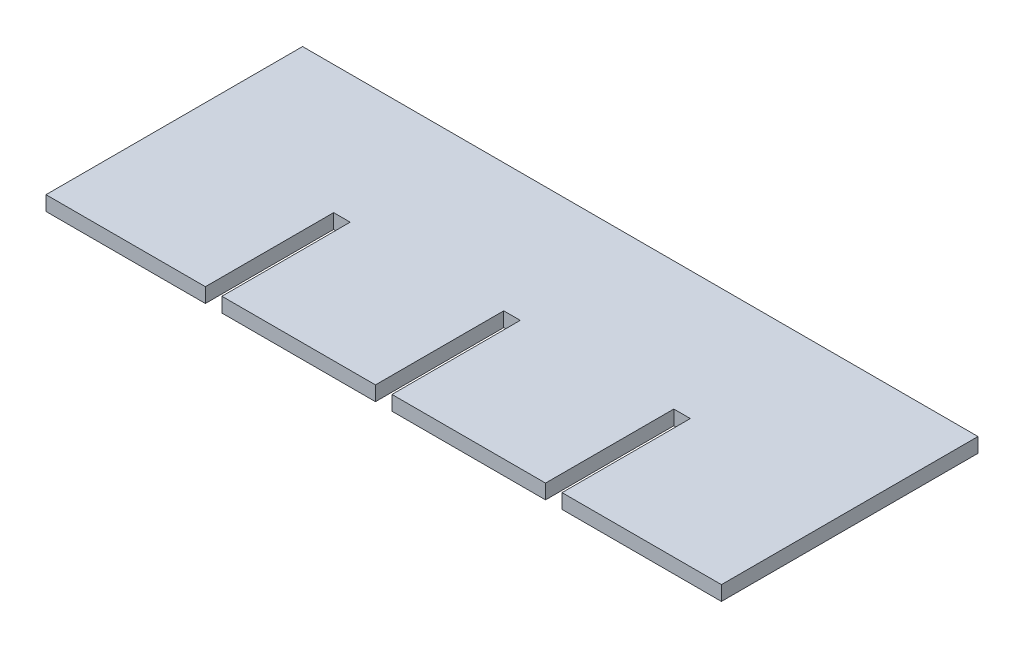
from build123d import *

# Parameters (mm, degrees)
CROQUIS14_W             = 69.5
CROQUIS14_H             = 1.5
SALIENTE_EXTRUIR8_DEPTH = 26.4
CROQUIS17_W             = 1.7
CROQUIS17_H             = 13.2
CORTAR_EXTRUIR1_DEPTH   = 1.5


with BuildPart() as part:
    # Croquis14 → Saliente-Extruir8 (new body)
    with BuildSketch(Plane.XY):
        with Locations((0, -20)):
            Rectangle(CROQUIS14_W, CROQUIS14_H)
    extrude(amount=SALIENTE_EXTRUIR8_DEPTH)

    # Croquis17 → Cortar-Extruir1 (cut)
    with BuildSketch(Plane.XZ.offset(20.75)):
        with Locations((-17.5, 19.8)):
            Rectangle(CROQUIS17_W, CROQUIS17_H)
        with Locations((17.5, 19.8)):
            Rectangle(CROQUIS17_W, CROQUIS17_H)
        with Locations((0, 19.8)):
            Rectangle(CROQUIS17_W, CROQUIS17_H)
    extrude(amount=-CORTAR_EXTRUIR1_DEPTH, mode=Mode.SUBTRACT)


solid = part.part
